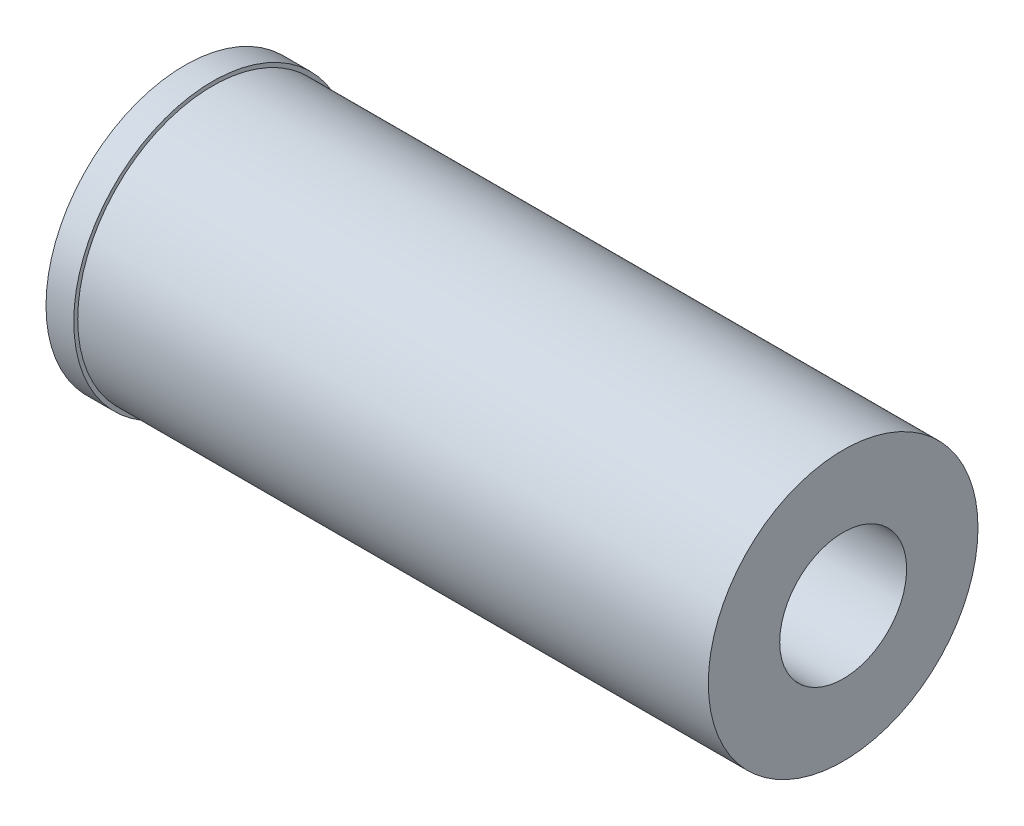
ISO-10303-21;
HEADER;
FILE_DESCRIPTION(('STEP AP214'),'2;1');
FILE_NAME('part.step','',(''),(''),'','','');
FILE_SCHEMA(('AUTOMOTIVE_DESIGN { 1 0 10303 214 1 1 1 1 }'));
ENDSEC;
DATA;
#1=APPLICATION_CONTEXT('core data for automotive mechanical design processes');
#2=APPLICATION_PROTOCOL_DEFINITION('international standard','automotive_design',2000,#1);
#3=PRODUCT_CONTEXT('',#1,'mechanical');
#4=PRODUCT('Part','Part','',(#3));
#5=PRODUCT_RELATED_PRODUCT_CATEGORY('part','',(#4));
#6=PRODUCT_DEFINITION_FORMATION('','',#4);
#7=PRODUCT_DEFINITION_CONTEXT('part definition',#1,'design');
#8=PRODUCT_DEFINITION('design','',#6,#7);
#9=PRODUCT_DEFINITION_SHAPE('','',#8);
#10=(LENGTH_UNIT() NAMED_UNIT(*) SI_UNIT(.MILLI.,.METRE.));
#11=(NAMED_UNIT(*) PLANE_ANGLE_UNIT() SI_UNIT($,.RADIAN.));
#12=(NAMED_UNIT(*) SI_UNIT($,.STERADIAN.) SOLID_ANGLE_UNIT());
#13=UNCERTAINTY_MEASURE_WITH_UNIT(LENGTH_MEASURE(1.E-05),#10,'distance_accuracy_value','');
#14=(GEOMETRIC_REPRESENTATION_CONTEXT(3) GLOBAL_UNCERTAINTY_ASSIGNED_CONTEXT((#13)) GLOBAL_UNIT_ASSIGNED_CONTEXT((#10,
#11,#12)) REPRESENTATION_CONTEXT('',''));
#15=CARTESIAN_POINT('',(0.,0.,0.));
#16=DIRECTION('',(0.,0.,1.));
#17=DIRECTION('',(1.,0.,0.));
#18=AXIS2_PLACEMENT_3D('',#15,#16,#17);
#19=CARTESIAN_POINT('',(0.,0.,0.));
#20=DIRECTION('',(1.,0.,0.));
#21=DIRECTION('',(0.,0.,-1.));
#22=AXIS2_PLACEMENT_3D('',#19,#20,#21);
#23=PLANE('',#22);
#24=CARTESIAN_POINT('',(0.,0.,0.));
#25=DIRECTION('',(-1.,0.,0.));
#26=DIRECTION('',(0.,0.,1.));
#27=AXIS2_PLACEMENT_3D('',#24,#25,#26);
#28=CIRCLE('',#27,3.5);
#29=CARTESIAN_POINT('',(0.,0.,3.5));
#30=VERTEX_POINT('',#29);
#31=EDGE_CURVE('E10',#30,#30,#28,.T.);
#32=ORIENTED_EDGE('',*,*,#31,.T.);
#33=EDGE_LOOP('',(#32));
#34=FACE_BOUND('',#33,.T.);
#35=ADVANCED_FACE('F28',(#34),#23,.F.);
#36=CARTESIAN_POINT('',(0.,0.,0.));
#37=DIRECTION('',(-1.,0.,0.));
#38=DIRECTION('',(0.,0.,1.));
#39=AXIS2_PLACEMENT_3D('',#36,#37,#38);
#40=CYLINDRICAL_SURFACE('',#39,3.5);
#41=ORIENTED_EDGE('',*,*,#31,.F.);
#42=EDGE_LOOP('',(#41));
#43=FACE_BOUND('',#42,.T.);
#44=CARTESIAN_POINT('',(0.7,0.,0.));
#45=DIRECTION('',(-1.,0.,0.));
#46=DIRECTION('',(0.,0.,1.));
#47=AXIS2_PLACEMENT_3D('',#44,#45,#46);
#48=CIRCLE('',#47,3.5);
#49=CARTESIAN_POINT('',(0.7,0.,3.5));
#50=VERTEX_POINT('',#49);
#51=EDGE_CURVE('E34',#50,#50,#48,.T.);
#52=ORIENTED_EDGE('',*,*,#51,.T.);
#53=EDGE_LOOP('',(#52));
#54=FACE_BOUND('',#53,.T.);
#55=ADVANCED_FACE('F72',(#43,#54),#40,.T.);
#56=CARTESIAN_POINT('',(0.7,3.5,0.));
#57=DIRECTION('',(-1.,0.,0.));
#58=DIRECTION('',(0.,0.,1.));
#59=AXIS2_PLACEMENT_3D('',#56,#57,#58);
#60=PLANE('',#59);
#61=ORIENTED_EDGE('',*,*,#51,.F.);
#62=EDGE_LOOP('',(#61));
#63=FACE_BOUND('',#62,.T.);
#64=CARTESIAN_POINT('',(0.7,0.,0.));
#65=DIRECTION('',(-1.,0.,0.));
#66=DIRECTION('',(0.,0.,1.));
#67=AXIS2_PLACEMENT_3D('',#64,#65,#66);
#68=CIRCLE('',#67,3.4);
#69=CARTESIAN_POINT('',(0.7,0.,3.4));
#70=VERTEX_POINT('',#69);
#71=EDGE_CURVE('E38',#70,#70,#68,.T.);
#72=ORIENTED_EDGE('',*,*,#71,.T.);
#73=EDGE_LOOP('',(#72));
#74=FACE_BOUND('',#73,.T.);
#75=ADVANCED_FACE('F76',(#63,#74),#60,.F.);
#76=CARTESIAN_POINT('',(0.,0.,0.));
#77=DIRECTION('',(-1.,0.,0.));
#78=DIRECTION('',(0.,0.,1.));
#79=AXIS2_PLACEMENT_3D('',#76,#77,#78);
#80=CYLINDRICAL_SURFACE('',#79,3.4);
#81=ORIENTED_EDGE('',*,*,#71,.F.);
#82=EDGE_LOOP('',(#81));
#83=FACE_BOUND('',#82,.T.);
#84=CARTESIAN_POINT('',(16.6,0.,0.));
#85=DIRECTION('',(-1.,0.,0.));
#86=DIRECTION('',(0.,0.,1.));
#87=AXIS2_PLACEMENT_3D('',#84,#85,#86);
#88=CIRCLE('',#87,3.4);
#89=CARTESIAN_POINT('',(16.6,0.,3.4));
#90=VERTEX_POINT('',#89);
#91=EDGE_CURVE('E42',#90,#90,#88,.T.);
#92=ORIENTED_EDGE('',*,*,#91,.T.);
#93=EDGE_LOOP('',(#92));
#94=FACE_BOUND('',#93,.T.);
#95=ADVANCED_FACE('F81',(#83,#94),#80,.T.);
#96=CARTESIAN_POINT('',(16.6,3.4,0.));
#97=DIRECTION('',(-1.,0.,0.));
#98=DIRECTION('',(0.,0.,1.));
#99=AXIS2_PLACEMENT_3D('',#96,#97,#98);
#100=PLANE('',#99);
#101=ORIENTED_EDGE('',*,*,#91,.F.);
#102=EDGE_LOOP('',(#101));
#103=FACE_BOUND('',#102,.T.);
#104=CARTESIAN_POINT('',(16.6,0.,0.));
#105=DIRECTION('',(-1.,0.,0.));
#106=DIRECTION('',(0.,0.,1.));
#107=AXIS2_PLACEMENT_3D('',#104,#105,#106);
#108=CIRCLE('',#107,1.6);
#109=CARTESIAN_POINT('',(16.6,0.,1.6));
#110=VERTEX_POINT('',#109);
#111=EDGE_CURVE('E47',#110,#110,#108,.T.);
#112=ORIENTED_EDGE('',*,*,#111,.T.);
#113=EDGE_LOOP('',(#112));
#114=FACE_BOUND('',#113,.T.);
#115=ADVANCED_FACE('F87',(#103,#114),#100,.F.);
#116=CARTESIAN_POINT('',(0.,0.,0.));
#117=DIRECTION('',(-1.,0.,0.));
#118=DIRECTION('',(0.,0.,1.));
#119=AXIS2_PLACEMENT_3D('',#116,#117,#118);
#120=CYLINDRICAL_SURFACE('',#119,1.6);
#121=ORIENTED_EDGE('',*,*,#111,.F.);
#122=EDGE_LOOP('',(#121));
#123=FACE_BOUND('',#122,.T.);
#124=CARTESIAN_POINT('',(1.5,0.,0.));
#125=DIRECTION('',(-1.,0.,0.));
#126=DIRECTION('',(0.,0.,1.));
#127=AXIS2_PLACEMENT_3D('',#124,#125,#126);
#128=CIRCLE('',#127,1.6);
#129=CARTESIAN_POINT('',(1.5,0.,1.6));
#130=VERTEX_POINT('',#129);
#131=EDGE_CURVE('E50',#130,#130,#128,.T.);
#132=ORIENTED_EDGE('',*,*,#131,.T.);
#133=EDGE_LOOP('',(#132));
#134=FACE_BOUND('',#133,.T.);
#135=ADVANCED_FACE('F91',(#123,#134),#120,.F.);
#136=CARTESIAN_POINT('',(1.5,1.6,0.));
#137=DIRECTION('',(-1.,0.,0.));
#138=DIRECTION('',(0.,0.,1.));
#139=AXIS2_PLACEMENT_3D('',#136,#137,#138);
#140=PLANE('',#139);
#141=ORIENTED_EDGE('',*,*,#131,.F.);
#142=EDGE_LOOP('',(#141));
#143=FACE_BOUND('',#142,.T.);
#144=CARTESIAN_POINT('',(1.5,0.,0.));
#145=DIRECTION('',(-1.,0.,0.));
#146=DIRECTION('',(0.,0.,1.));
#147=AXIS2_PLACEMENT_3D('',#144,#145,#146);
#148=CIRCLE('',#147,0.8);
#149=CARTESIAN_POINT('',(1.5,0.,0.8));
#150=VERTEX_POINT('',#149);
#151=EDGE_CURVE('E53',#150,#150,#148,.T.);
#152=ORIENTED_EDGE('',*,*,#151,.T.);
#153=EDGE_LOOP('',(#152));
#154=FACE_BOUND('',#153,.T.);
#155=ADVANCED_FACE('F68',(#143,#154),#140,.F.);
#156=CARTESIAN_POINT('',(0.,0.,0.));
#157=DIRECTION('',(-1.,0.,0.));
#158=DIRECTION('',(0.,0.,1.));
#159=AXIS2_PLACEMENT_3D('',#156,#157,#158);
#160=CYLINDRICAL_SURFACE('',#159,0.8);
#161=ORIENTED_EDGE('',*,*,#151,.F.);
#162=EDGE_LOOP('',(#161));
#163=FACE_BOUND('',#162,.T.);
#164=CARTESIAN_POINT('',(0.7,0.,0.));
#165=DIRECTION('',(-1.,0.,0.));
#166=DIRECTION('',(0.,0.,1.));
#167=AXIS2_PLACEMENT_3D('',#164,#165,#166);
#168=CIRCLE('',#167,0.8);
#169=CARTESIAN_POINT('',(0.7,0.,0.8));
#170=VERTEX_POINT('',#169);
#171=EDGE_CURVE('E56',#170,#170,#168,.T.);
#172=ORIENTED_EDGE('',*,*,#171,.T.);
#173=EDGE_LOOP('',(#172));
#174=FACE_BOUND('',#173,.T.);
#175=ADVANCED_FACE('F60',(#163,#174),#160,.F.);
#176=CARTESIAN_POINT('',(0.7,0.8,0.));
#177=DIRECTION('',(-1.,0.,0.));
#178=DIRECTION('',(0.,0.,1.));
#179=AXIS2_PLACEMENT_3D('',#176,#177,#178);
#180=PLANE('',#179);
#181=ORIENTED_EDGE('',*,*,#171,.F.);
#182=EDGE_LOOP('',(#181));
#183=FACE_BOUND('',#182,.T.);
#184=ADVANCED_FACE('F62',(#183),#180,.F.);
#185=CLOSED_SHELL('',(#35,#55,#75,#95,#115,#135,#155,#175,#184));
#186=MANIFOLD_SOLID_BREP('B2',#185);
#187=ADVANCED_BREP_SHAPE_REPRESENTATION('',(#18,#186),#14);
#188=SHAPE_DEFINITION_REPRESENTATION(#9,#187);
ENDSEC;
END-ISO-10303-21;
